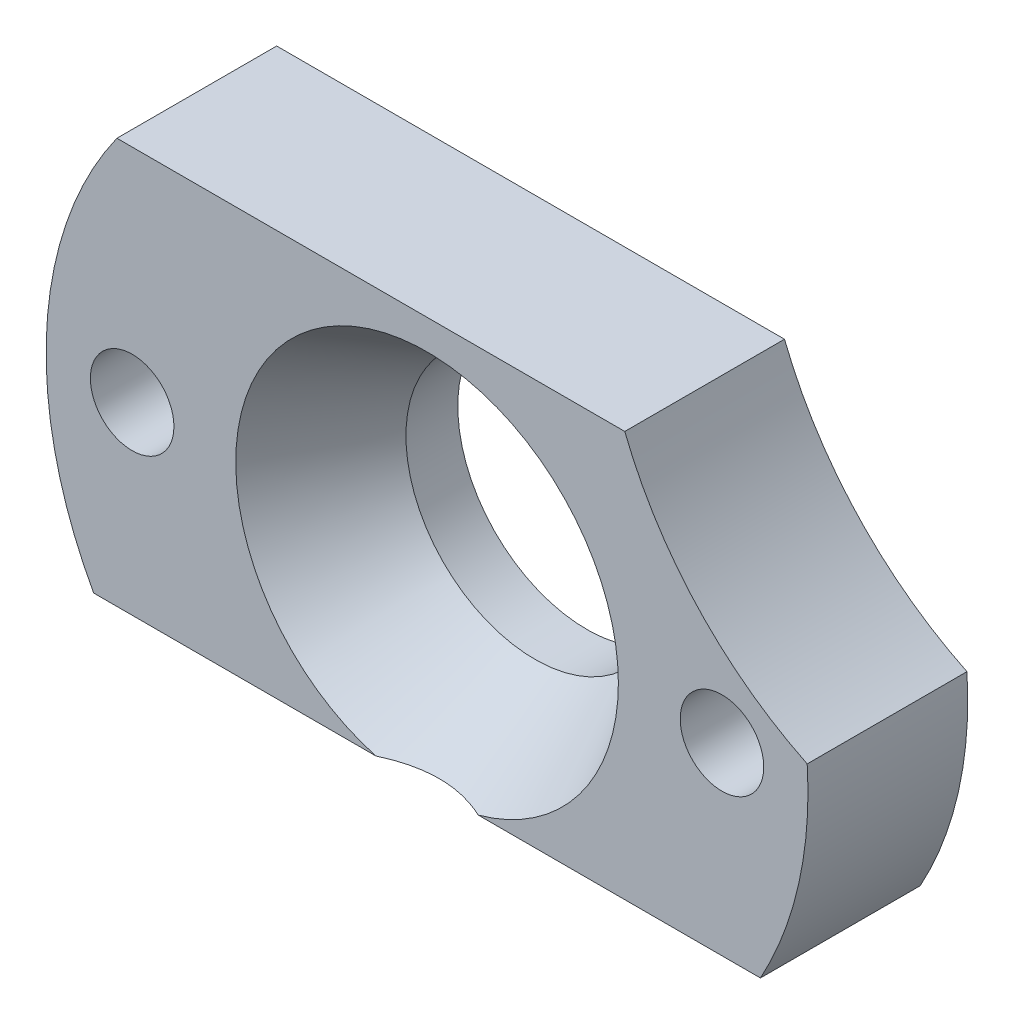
from build123d import *

# Parameters (mm, degrees)
LINEAR_AUSTRAGEN1_DEPTH          = 6.5
F_3_4_3_4_DURCHMESSER_BOHRUNG1_D = 3.4
SKIZZE7_R                        = 15
SCHNITT_LINEAR_AUSTRAGEN1_DEPTH  = 20.065675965


with BuildPart() as part:
    # Skizze1 → Linear austragen1 (new body)
    with BuildSketch(Plane.XY):
        with BuildLine():
            Line((13.564659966, -7.5), (-13.564659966, -7.5))
            ThreePointArc((-13.564659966, -7.5), (-15.474628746, 0.88649037), (-12.619429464, 9))
            Line((-12.619429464, 9), (12.619429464, 9))
            ThreePointArc((12.619429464, 9), (15.474628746, 0.88649037), (13.564659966, -7.5))
        make_face()
    extrude(amount=LINEAR_AUSTRAGEN1_DEPTH)

    # 3.4 _3.4_ Durchmesser Bohrung1 (through all)
    with Locations(Plane.XY.offset(6.5)):
        with Locations((-12, 0), (12, 0)):
            Hole(F_3_4_3_4_DURCHMESSER_BOHRUNG1_D / 2)

    # Skizze4 → Formsenkung f_r M1.6 Linsensenkschraube (revolve, cut)
    with BuildSketch(Plane(origin=(0, 0, 6.5), x_dir=(0, -1, 0), z_dir=(1, 0, 0))):
        Polygon((0, 0), (0, 6.5), (5.25, 6.5), (5.25, 4.39), (7.784567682, 0), align=None)
    revolve(axis=Axis((0, 0, 12.85), (0, 0, -1)), mode=Mode.SUBTRACT)

    # Skizze7 → Schnitt-Linear austragen1 (cut, through all)
    with BuildSketch(Plane(origin=(0, 0, 0), x_dir=(-1, 0, 0), z_dir=(0, 0, -1))):
        with Locations((-22, 14.5)):
            Circle(SKIZZE7_R)
    extrude(amount=-SCHNITT_LINEAR_AUSTRAGEN1_DEPTH, mode=Mode.SUBTRACT)


solid = part.part
